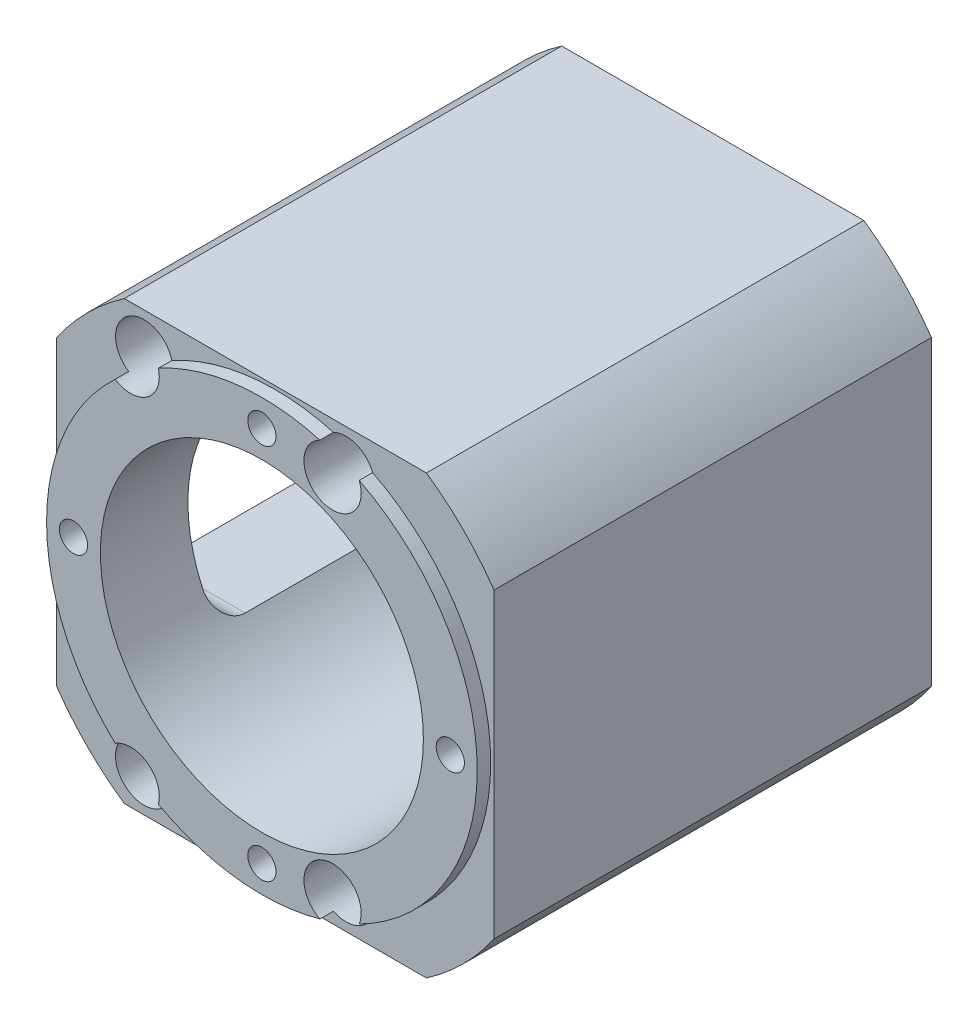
from build123d import *

# Parameters (mm, degrees)
SKETCH_1_R                   = 24
EXTRUDE_1_DEPTH              = 69
SKETCH_2_R                   = 56.77516202
SKETCH_2_R_2                 = 32
CUT_EXTRUDE_1_DEPTH          = 4
HOLE_WIZARD_M5_1_D           = 5.3
HOLE_WIZARD_M5_1_CBORE_D     = 8.5
HOLE_WIZARD_M5_1_CBORE_DEPTH = 46
HOLE_WIZARD_M5_1_2_D         = 4.2
HOLE_WIZARD_M5_1_2_DEPTH     = 20
HOLE_WIZARD_M5_1_2_TIP       = 1.2618073
SKETCH_10_R                  = 74.388382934
CUT_EXTRUDE_5_DEPTH          = 2
MM_1_D                       = 4
MM_1_DEPTH                   = 12
MM_1_TIP                     = 1.201721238
CUT_EXTRUDE_6_DEPTH          = 15


with BuildPart() as part:
    # Sketch 1 → Extrude 1 (new body)
    with BuildSketch(Plane.XY):
        with BuildLine():
            Line((22.449944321, 32.5), (-22.449944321, 32.5))
            ThreePointArc((-22.449944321, 32.5), (-27.930717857, 27.930717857), (-32.5, 22.449944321))
            Line((-32.5, 22.449944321), (-32.5, -22.449944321))
            ThreePointArc((-32.5, -22.449944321), (-27.930717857, -27.930717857), (-22.449944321, -32.5))
            Line((-22.449944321, -32.5), (22.449944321, -32.5))
            ThreePointArc((22.449944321, -32.5), (27.930717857, -27.930717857), (32.5, -22.449944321))
            Line((32.5, -22.449944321), (32.5, 22.449944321))
            ThreePointArc((32.5, 22.449944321), (27.930717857, 27.930717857), (22.449944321, 32.5))
        make_face()
        Circle(SKETCH_1_R, mode=Mode.SUBTRACT)
    extrude(amount=EXTRUDE_1_DEPTH)

    # Sketch 2 → Cut-Extrude 1 (cut)
    with BuildSketch(Plane.XY.offset(69)):
        Circle(SKETCH_2_R)
        Circle(SKETCH_2_R_2, mode=Mode.SUBTRACT)
    extrude(amount=-CUT_EXTRUDE_1_DEPTH, mode=Mode.SUBTRACT)

    # Hole Wizard M5 _1 (through all)
    with Locations(Plane.XY.offset(69)):
        with Locations((10.5, -27), (10.5, 27), (-19.5, 27), (-19.5, -27)):
            CounterBoreHole(HOLE_WIZARD_M5_1_D / 2, HOLE_WIZARD_M5_1_CBORE_D / 2, HOLE_WIZARD_M5_1_CBORE_DEPTH)

    # Hole Wizard M5 _1 2
    with Locations(Plane.XY.offset(69)):
        with Locations((0, 28), (28, 0), (0, -28), (-28, 0), (0, 0)):
            Hole(HOLE_WIZARD_M5_1_2_D / 2, depth=HOLE_WIZARD_M5_1_2_DEPTH)
            with Locations((0, 0, -(HOLE_WIZARD_M5_1_2_DEPTH + HOLE_WIZARD_M5_1_2_TIP / 2))):  # 118° drill point
                Cone(0, HOLE_WIZARD_M5_1_2_D / 2, HOLE_WIZARD_M5_1_2_TIP, mode=Mode.SUBTRACT)

    # Sketch 10 → Cut-Extrude 5 (cut)
    with BuildSketch(Plane.XY.offset(69)):
        Circle(SKETCH_10_R)
    extrude(amount=-CUT_EXTRUDE_5_DEPTH, mode=Mode.SUBTRACT)

    # mm _1
    with Locations(Plane(origin=(0, 0, 0), x_dir=(-1, 0, 0), z_dir=(0, 0, -1))):
        with Locations((0, 28), (0, -28)):
            Hole(MM_1_D / 2, depth=MM_1_DEPTH)
            with Locations((0, 0, -(MM_1_DEPTH + MM_1_TIP / 2))):  # 118° drill point
                Cone(0, MM_1_D / 2, MM_1_TIP, mode=Mode.SUBTRACT)

    # Sketch 15 → Cut-Extrude 6 (cut)
    with BuildSketch(Plane.ZY.offset(32.5)):
        with BuildLine():
            Line((13, 14), (50, 14))
            ThreePointArc((50, 14), (52.828427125, 12.828427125), (54, 10))
            Line((54, 10), (54, -10))
            ThreePointArc((54, -10), (52.828427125, -12.828427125), (50, -14))
            Line((50, -14), (13, -14))
            ThreePointArc((13, -14), (10.171572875, -12.828427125), (9, -10))
            Line((9, -10), (9, 10))
            ThreePointArc((9, 10), (10.171572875, 12.828427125), (13, 14))
        make_face()
    extrude(amount=-CUT_EXTRUDE_6_DEPTH, mode=Mode.SUBTRACT)


solid = part.part
